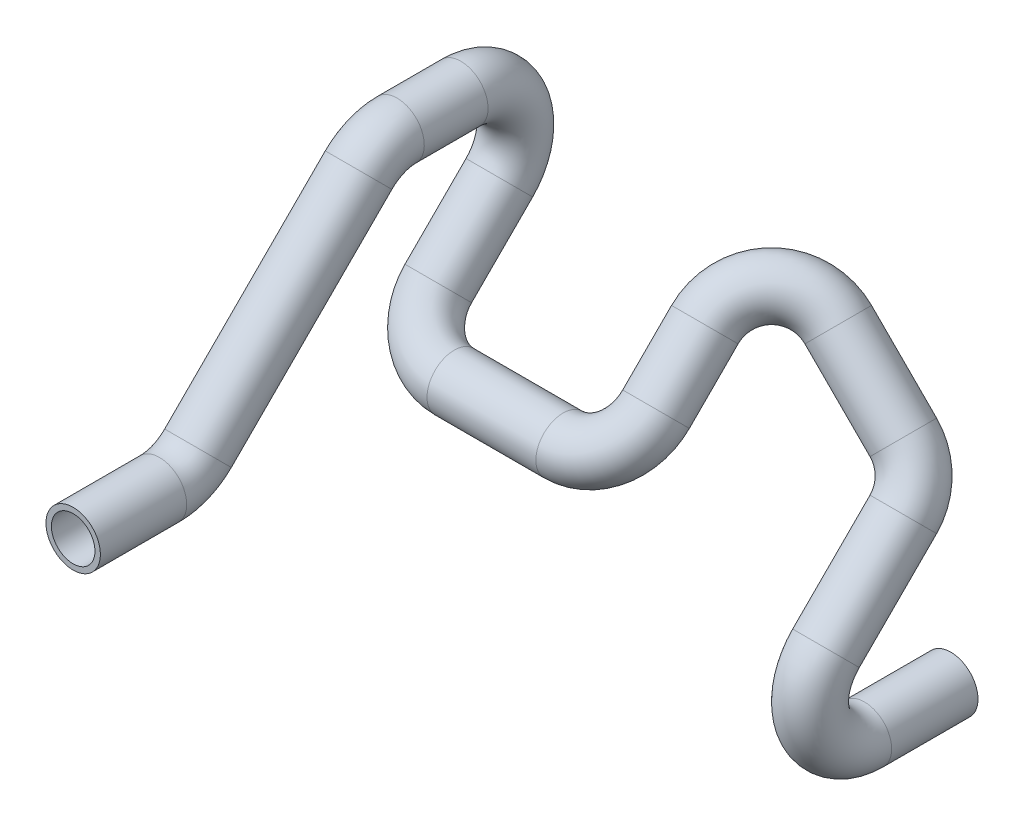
ISO-10303-21;
HEADER;
FILE_DESCRIPTION(('STEP AP214'),'2;1');
FILE_NAME('part.step','',(''),(''),'','','');
FILE_SCHEMA(('AUTOMOTIVE_DESIGN { 1 0 10303 214 1 1 1 1 }'));
ENDSEC;
DATA;
#1=APPLICATION_CONTEXT('core data for automotive mechanical design processes');
#2=APPLICATION_PROTOCOL_DEFINITION('international standard','automotive_design',2000,#1);
#3=PRODUCT_CONTEXT('',#1,'mechanical');
#4=PRODUCT('Part','Part','',(#3));
#5=PRODUCT_RELATED_PRODUCT_CATEGORY('part','',(#4));
#6=PRODUCT_DEFINITION_FORMATION('','',#4);
#7=PRODUCT_DEFINITION_CONTEXT('part definition',#1,'design');
#8=PRODUCT_DEFINITION('design','',#6,#7);
#9=PRODUCT_DEFINITION_SHAPE('','',#8);
#10=(LENGTH_UNIT() NAMED_UNIT(*) SI_UNIT(.MILLI.,.METRE.));
#11=(NAMED_UNIT(*) PLANE_ANGLE_UNIT() SI_UNIT($,.RADIAN.));
#12=(NAMED_UNIT(*) SI_UNIT($,.STERADIAN.) SOLID_ANGLE_UNIT());
#13=UNCERTAINTY_MEASURE_WITH_UNIT(LENGTH_MEASURE(1.E-05),#10,'distance_accuracy_value','');
#14=(GEOMETRIC_REPRESENTATION_CONTEXT(3) GLOBAL_UNCERTAINTY_ASSIGNED_CONTEXT((#13)) GLOBAL_UNIT_ASSIGNED_CONTEXT((#10,
#11,#12)) REPRESENTATION_CONTEXT('',''));
#15=CARTESIAN_POINT('',(0.,0.,0.));
#16=DIRECTION('',(0.,0.,1.));
#17=DIRECTION('',(1.,0.,0.));
#18=AXIS2_PLACEMENT_3D('',#15,#16,#17);
#19=CARTESIAN_POINT('',(-14.8789755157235,-44.9012806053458,-72.4802561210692));
#20=DIRECTION('',(0.,0.,-1.));
#21=DIRECTION('',(0.,1.,0.));
#22=AXIS2_PLACEMENT_3D('',#19,#20,#21);
#23=CYLINDRICAL_SURFACE('',#22,6.35);
#24=CARTESIAN_POINT('',(-14.8789755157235,-44.9012806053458,-72.4802561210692));
#25=DIRECTION('',(0.,0.,1.));
#26=DIRECTION('',(0.333333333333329,0.942809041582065,0.));
#27=AXIS2_PLACEMENT_3D('',#24,#25,#26);
#28=CIRCLE('',#27,6.35);
#29=CARTESIAN_POINT('',(-14.8789755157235,-51.2512806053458,-72.4802561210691));
#30=VERTEX_POINT('',#29);
#31=EDGE_CURVE('E41',#30,#30,#28,.T.);
#32=ORIENTED_EDGE('',*,*,#31,.F.);
#33=EDGE_LOOP('',(#32));
#34=FACE_BOUND('',#33,.T.);
#35=CARTESIAN_POINT('',(-14.8789755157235,-44.9012806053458,-92.6197438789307));
#36=DIRECTION('',(0.,0.,1.));
#37=DIRECTION('',(0.333333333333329,0.942809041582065,0.));
#38=AXIS2_PLACEMENT_3D('',#35,#36,#37);
#39=CIRCLE('',#38,6.35);
#40=CARTESIAN_POINT('',(-12.7623088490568,-38.9144431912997,-92.6197438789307));
#41=VERTEX_POINT('',#40);
#42=EDGE_CURVE('E10',#41,#41,#39,.T.);
#43=ORIENTED_EDGE('',*,*,#42,.T.);
#44=EDGE_LOOP('',(#43));
#45=FACE_BOUND('',#44,.T.);
#46=ADVANCED_FACE('F31',(#34,#45),#23,.T.);
#47=CARTESIAN_POINT('',(-14.8789755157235,-44.9012806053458,-72.4802561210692));
#48=DIRECTION('',(0.,0.,-1.));
#49=DIRECTION('',(0.,1.,0.));
#50=AXIS2_PLACEMENT_3D('',#47,#48,#49);
#51=CYLINDRICAL_SURFACE('',#50,5.08);
#52=CARTESIAN_POINT('',(-14.8789755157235,-44.9012806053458,-72.4802561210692));
#53=DIRECTION('',(0.,0.,1.));
#54=DIRECTION('',(0.333333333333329,0.942809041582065,0.));
#55=AXIS2_PLACEMENT_3D('',#52,#53,#54);
#56=CIRCLE('',#55,5.08);
#57=CARTESIAN_POINT('',(-14.8789755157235,-49.9812806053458,-72.4802561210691));
#58=VERTEX_POINT('',#57);
#59=EDGE_CURVE('E45',#58,#58,#56,.T.);
#60=ORIENTED_EDGE('',*,*,#59,.T.);
#61=EDGE_LOOP('',(#60));
#62=FACE_BOUND('',#61,.T.);
#63=CARTESIAN_POINT('',(-14.8789755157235,-44.9012806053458,-92.6197438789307));
#64=DIRECTION('',(0.,0.,1.));
#65=DIRECTION('',(0.333333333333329,0.942809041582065,0.));
#66=AXIS2_PLACEMENT_3D('',#63,#64,#65);
#67=CIRCLE('',#66,5.08);
#68=CARTESIAN_POINT('',(-13.1856421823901,-40.1118106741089,-92.6197438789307));
#69=VERTEX_POINT('',#68);
#70=EDGE_CURVE('E37',#69,#69,#67,.T.);
#71=ORIENTED_EDGE('',*,*,#70,.F.);
#72=EDGE_LOOP('',(#71));
#73=FACE_BOUND('',#72,.T.);
#74=ADVANCED_FACE('F169',(#62,#73),#51,.F.);
#75=CARTESIAN_POINT('',(-14.8789755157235,-32.2012806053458,-72.4802561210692));
#76=DIRECTION('',(1.,0.,0.));
#77=DIRECTION('',(0.,0.,-1.));
#78=AXIS2_PLACEMENT_3D('',#75,#76,#77);
#79=TOROIDAL_SURFACE('',#78,12.7,6.35);
#80=CARTESIAN_POINT('',(-14.8789755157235,-23.2210244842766,-63.5000000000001));
#81=DIRECTION('',(0.,0.707106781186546,-0.707106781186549));
#82=DIRECTION('',(0.333333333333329,-0.666666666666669,-0.666666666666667));
#83=AXIS2_PLACEMENT_3D('',#80,#81,#82);
#84=CIRCLE('',#83,6.35);
#85=CARTESIAN_POINT('',(-14.8789755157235,-18.730896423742,-59.0098719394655));
#86=VERTEX_POINT('',#85);
#87=EDGE_CURVE('E50',#86,#86,#84,.T.);
#88=CARTESIAN_POINT('',(-14.8789755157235,-32.2012806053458,-72.4802561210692));
#89=DIRECTION('',(1.,0.,0.));
#90=DIRECTION('',(0.,0.,-1.));
#91=AXIS2_PLACEMENT_3D('',#88,#89,#90);
#92=CIRCLE('',#91,19.05);
#93=EDGE_CURVE('',#86,#30,#92,.T.);
#94=ORIENTED_EDGE('',*,*,#87,.F.);
#95=ORIENTED_EDGE('',*,*,#31,.T.);
#96=ORIENTED_EDGE('',*,*,#93,.T.);
#97=ORIENTED_EDGE('',*,*,#93,.F.);
#98=EDGE_LOOP('',(#94,#96,#95,#97));
#99=FACE_BOUND('',#98,.T.);
#100=ADVANCED_FACE('F174',(#99),#79,.T.);
#101=CARTESIAN_POINT('',(-14.8789755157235,-32.2012806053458,-72.4802561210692));
#102=DIRECTION('',(1.,0.,0.));
#103=DIRECTION('',(0.,0.,-1.));
#104=AXIS2_PLACEMENT_3D('',#101,#102,#103);
#105=TOROIDAL_SURFACE('',#104,12.7,5.08);
#106=CARTESIAN_POINT('',(-14.8789755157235,-23.2210244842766,-63.5000000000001));
#107=DIRECTION('',(0.,0.707106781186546,-0.707106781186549));
#108=DIRECTION('',(0.333333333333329,-0.666666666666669,-0.666666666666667));
#109=AXIS2_PLACEMENT_3D('',#106,#107,#108);
#110=CIRCLE('',#109,5.08);
#111=CARTESIAN_POINT('',(-14.8789755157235,-19.6289220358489,-59.9078975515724));
#112=VERTEX_POINT('',#111);
#113=EDGE_CURVE('E53',#112,#112,#110,.T.);
#114=CARTESIAN_POINT('',(-14.8789755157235,-32.2012806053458,-72.4802561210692));
#115=DIRECTION('',(1.,0.,0.));
#116=DIRECTION('',(0.,0.,-1.));
#117=AXIS2_PLACEMENT_3D('',#114,#115,#116);
#118=CIRCLE('',#117,17.78);
#119=EDGE_CURVE('',#112,#58,#118,.T.);
#120=ORIENTED_EDGE('',*,*,#113,.T.);
#121=ORIENTED_EDGE('',*,*,#59,.F.);
#122=ORIENTED_EDGE('',*,*,#119,.T.);
#123=ORIENTED_EDGE('',*,*,#119,.F.);
#124=EDGE_LOOP('',(#120,#122,#121,#123));
#125=FACE_BOUND('',#124,.T.);
#126=ADVANCED_FACE('F179',(#125),#105,.F.);
#127=CARTESIAN_POINT('',(-14.8789755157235,-5.1847532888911,-81.5362711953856));
#128=DIRECTION('',(0.,-0.707106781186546,0.707106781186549));
#129=DIRECTION('',(0.,-0.707106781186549,-0.707106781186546));
#130=AXIS2_PLACEMENT_3D('',#127,#128,#129);
#131=CYLINDRICAL_SURFACE('',#130,6.35);
#132=CARTESIAN_POINT('',(-14.8789755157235,-5.1847532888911,-81.5362711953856));
#133=DIRECTION('',(0.,0.707106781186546,-0.707106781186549));
#134=DIRECTION('',(0.333333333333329,-0.666666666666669,-0.666666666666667));
#135=AXIS2_PLACEMENT_3D('',#132,#133,#134);
#136=CIRCLE('',#135,6.35);
#137=CARTESIAN_POINT('',(-9.69422222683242,-7.77712993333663,-84.1286478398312));
#138=VERTEX_POINT('',#137);
#139=EDGE_CURVE('E56',#138,#138,#136,.T.);
#140=ORIENTED_EDGE('',*,*,#139,.F.);
#141=EDGE_LOOP('',(#140));
#142=FACE_BOUND('',#141,.T.);
#143=ORIENTED_EDGE('',*,*,#87,.T.);
#144=EDGE_LOOP('',(#143));
#145=FACE_BOUND('',#144,.T.);
#146=ADVANCED_FACE('F185',(#142,#145),#131,.T.);
#147=CARTESIAN_POINT('',(-14.8789755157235,-5.1847532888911,-81.5362711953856));
#148=DIRECTION('',(0.,-0.707106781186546,0.707106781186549));
#149=DIRECTION('',(0.,-0.707106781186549,-0.707106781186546));
#150=AXIS2_PLACEMENT_3D('',#147,#148,#149);
#151=CYLINDRICAL_SURFACE('',#150,5.08);
#152=CARTESIAN_POINT('',(-14.8789755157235,-5.1847532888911,-81.5362711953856));
#153=DIRECTION('',(0.,0.707106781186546,-0.707106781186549));
#154=DIRECTION('',(0.333333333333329,-0.666666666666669,-0.666666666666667));
#155=AXIS2_PLACEMENT_3D('',#152,#153,#154);
#156=CIRCLE('',#155,5.08);
#157=CARTESIAN_POINT('',(-10.7311728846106,-7.25865460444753,-83.6101725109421));
#158=VERTEX_POINT('',#157);
#159=EDGE_CURVE('E59',#158,#158,#156,.T.);
#160=ORIENTED_EDGE('',*,*,#159,.T.);
#161=EDGE_LOOP('',(#160));
#162=FACE_BOUND('',#161,.T.);
#163=ORIENTED_EDGE('',*,*,#113,.F.);
#164=EDGE_LOOP('',(#163));
#165=FACE_BOUND('',#164,.T.);
#166=ADVANCED_FACE('F192',(#162,#165),#151,.F.);
#167=CARTESIAN_POINT('',(-25.2484820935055,0.,-76.3515179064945));
#168=DIRECTION('',(-0.577350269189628,-0.577350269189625,-0.577350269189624));
#169=DIRECTION('',(0.707106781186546,-0.707106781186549,0.));
#170=AXIS2_PLACEMENT_3D('',#167,#168,#169);
#171=TOROIDAL_SURFACE('',#170,12.7,6.35);
#172=CARTESIAN_POINT('',(-20.0637288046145,5.184753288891,-86.7210244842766));
#173=DIRECTION('',(-0.707106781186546,0.707106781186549,0.));
#174=DIRECTION('',(0.,0.,-1.));
#175=AXIS2_PLACEMENT_3D('',#172,#173,#174);
#176=CIRCLE('',#175,6.35);
#177=CARTESIAN_POINT('',(-17.471352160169,7.77712993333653,-91.9057777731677));
#178=VERTEX_POINT('',#177);
#179=EDGE_CURVE('E62',#178,#178,#176,.T.);
#180=CARTESIAN_POINT('',(-25.2484820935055,0.,-76.3515179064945));
#181=DIRECTION('',(-0.577350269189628,-0.577350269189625,-0.577350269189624));
#182=DIRECTION('',(0.707106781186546,-0.707106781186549,0.));
#183=AXIS2_PLACEMENT_3D('',#180,#181,#182);
#184=CIRCLE('',#183,19.05);
#185=EDGE_CURVE('',#178,#138,#184,.T.);
#186=ORIENTED_EDGE('',*,*,#179,.F.);
#187=ORIENTED_EDGE('',*,*,#139,.T.);
#188=ORIENTED_EDGE('',*,*,#185,.T.);
#189=ORIENTED_EDGE('',*,*,#185,.F.);
#190=EDGE_LOOP('',(#186,#188,#187,#189));
#191=FACE_BOUND('',#190,.T.);
#192=ADVANCED_FACE('F196',(#191),#171,.T.);
#193=CARTESIAN_POINT('',(-25.2484820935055,0.,-76.3515179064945));
#194=DIRECTION('',(-0.577350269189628,-0.577350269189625,-0.577350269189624));
#195=DIRECTION('',(0.707106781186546,-0.707106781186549,0.));
#196=AXIS2_PLACEMENT_3D('',#193,#194,#195);
#197=TOROIDAL_SURFACE('',#196,12.7,5.08);
#198=CARTESIAN_POINT('',(-20.0637288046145,5.184753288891,-86.7210244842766));
#199=DIRECTION('',(-0.707106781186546,0.707106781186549,0.));
#200=DIRECTION('',(0.,0.,-1.));
#201=AXIS2_PLACEMENT_3D('',#198,#199,#200);
#202=CIRCLE('',#201,5.08);
#203=CARTESIAN_POINT('',(-17.9898274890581,7.25865460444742,-90.8688271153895));
#204=VERTEX_POINT('',#203);
#205=EDGE_CURVE('E65',#204,#204,#202,.T.);
#206=CARTESIAN_POINT('',(-25.2484820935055,0.,-76.3515179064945));
#207=DIRECTION('',(-0.577350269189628,-0.577350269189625,-0.577350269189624));
#208=DIRECTION('',(0.707106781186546,-0.707106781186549,0.));
#209=AXIS2_PLACEMENT_3D('',#206,#207,#208);
#210=CIRCLE('',#209,17.78);
#211=EDGE_CURVE('',#204,#158,#210,.T.);
#212=ORIENTED_EDGE('',*,*,#205,.T.);
#213=ORIENTED_EDGE('',*,*,#159,.F.);
#214=ORIENTED_EDGE('',*,*,#211,.T.);
#215=ORIENTED_EDGE('',*,*,#211,.F.);
#216=EDGE_LOOP('',(#212,#214,#213,#215));
#217=FACE_BOUND('',#216,.T.);
#218=ADVANCED_FACE('F200',(#217),#197,.F.);
#219=CARTESIAN_POINT('',(-35.2457401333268,20.3667646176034,-86.7210244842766));
#220=DIRECTION('',(0.707106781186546,-0.707106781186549,0.));
#221=DIRECTION('',(0.707106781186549,0.707106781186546,0.));
#222=AXIS2_PLACEMENT_3D('',#219,#220,#221);
#223=CYLINDRICAL_SURFACE('',#222,6.35);
#224=CARTESIAN_POINT('',(-35.2457401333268,20.3667646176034,-86.7210244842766));
#225=DIRECTION('',(-0.707106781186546,0.707106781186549,0.));
#226=DIRECTION('',(0.,0.,-1.));
#227=AXIS2_PLACEMENT_3D('',#224,#225,#226);
#228=CIRCLE('',#227,6.35);
#229=CARTESIAN_POINT('',(-32.6533634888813,22.9591412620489,-91.9057777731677));
#230=VERTEX_POINT('',#229);
#231=EDGE_CURVE('E68',#230,#230,#228,.T.);
#232=ORIENTED_EDGE('',*,*,#231,.F.);
#233=EDGE_LOOP('',(#232));
#234=FACE_BOUND('',#233,.T.);
#235=ORIENTED_EDGE('',*,*,#179,.T.);
#236=EDGE_LOOP('',(#235));
#237=FACE_BOUND('',#236,.T.);
#238=ADVANCED_FACE('F204',(#234,#237),#223,.T.);
#239=CARTESIAN_POINT('',(-35.2457401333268,20.3667646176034,-86.7210244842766));
#240=DIRECTION('',(0.707106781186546,-0.707106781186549,0.));
#241=DIRECTION('',(0.707106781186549,0.707106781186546,0.));
#242=AXIS2_PLACEMENT_3D('',#239,#240,#241);
#243=CYLINDRICAL_SURFACE('',#242,5.08);
#244=CARTESIAN_POINT('',(-35.2457401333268,20.3667646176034,-86.7210244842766));
#245=DIRECTION('',(-0.707106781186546,0.707106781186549,0.));
#246=DIRECTION('',(0.,0.,-1.));
#247=AXIS2_PLACEMENT_3D('',#244,#245,#246);
#248=CIRCLE('',#247,5.08);
#249=CARTESIAN_POINT('',(-33.1718388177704,22.4406659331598,-90.8688271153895));
#250=VERTEX_POINT('',#249);
#251=EDGE_CURVE('E71',#250,#250,#248,.T.);
#252=ORIENTED_EDGE('',*,*,#251,.T.);
#253=EDGE_LOOP('',(#252));
#254=FACE_BOUND('',#253,.T.);
#255=ORIENTED_EDGE('',*,*,#205,.F.);
#256=EDGE_LOOP('',(#255));
#257=FACE_BOUND('',#256,.T.);
#258=ADVANCED_FACE('F208',(#254,#257),#243,.F.);
#259=CARTESIAN_POINT('',(-40.4304934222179,15.1820113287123,-76.3515179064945));
#260=DIRECTION('',(-0.577350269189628,-0.577350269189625,-0.577350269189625));
#261=DIRECTION('',(-0.707106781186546,0.,0.707106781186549));
#262=AXIS2_PLACEMENT_3D('',#259,#260,#261);
#263=TOROIDAL_SURFACE('',#262,12.7,6.35);
#264=CARTESIAN_POINT('',(-50.8,20.3667646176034,-71.1667646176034));
#265=DIRECTION('',(0.,-0.707106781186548,0.707106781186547));
#266=DIRECTION('',(-1.,0.,0.));
#267=AXIS2_PLACEMENT_3D('',#264,#265,#266);
#268=CIRCLE('',#267,6.35);
#269=CARTESIAN_POINT('',(-55.984753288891,22.9591412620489,-68.5743879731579));
#270=VERTEX_POINT('',#269);
#271=EDGE_CURVE('E74',#270,#270,#268,.T.);
#272=CARTESIAN_POINT('',(-40.4304934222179,15.1820113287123,-76.3515179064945));
#273=DIRECTION('',(-0.577350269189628,-0.577350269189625,-0.577350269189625));
#274=DIRECTION('',(-0.707106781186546,0.,0.707106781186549));
#275=AXIS2_PLACEMENT_3D('',#272,#273,#274);
#276=CIRCLE('',#275,19.05);
#277=EDGE_CURVE('',#270,#230,#276,.T.);
#278=ORIENTED_EDGE('',*,*,#271,.F.);
#279=ORIENTED_EDGE('',*,*,#231,.T.);
#280=ORIENTED_EDGE('',*,*,#277,.T.);
#281=ORIENTED_EDGE('',*,*,#277,.F.);
#282=EDGE_LOOP('',(#278,#280,#279,#281));
#283=FACE_BOUND('',#282,.T.);
#284=ADVANCED_FACE('F212',(#283),#263,.T.);
#285=CARTESIAN_POINT('',(-40.4304934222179,15.1820113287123,-76.3515179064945));
#286=DIRECTION('',(-0.577350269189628,-0.577350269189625,-0.577350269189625));
#287=DIRECTION('',(-0.707106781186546,0.,0.707106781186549));
#288=AXIS2_PLACEMENT_3D('',#285,#286,#287);
#289=TOROIDAL_SURFACE('',#288,12.7,5.08);
#290=CARTESIAN_POINT('',(-50.8,20.3667646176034,-71.1667646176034));
#291=DIRECTION('',(0.,-0.707106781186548,0.707106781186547));
#292=DIRECTION('',(-1.,0.,0.));
#293=AXIS2_PLACEMENT_3D('',#290,#291,#292);
#294=CIRCLE('',#293,5.08);
#295=CARTESIAN_POINT('',(-54.9478026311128,22.4406659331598,-69.092863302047));
#296=VERTEX_POINT('',#295);
#297=EDGE_CURVE('E77',#296,#296,#294,.T.);
#298=CARTESIAN_POINT('',(-40.4304934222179,15.1820113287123,-76.3515179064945));
#299=DIRECTION('',(-0.577350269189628,-0.577350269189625,-0.577350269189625));
#300=DIRECTION('',(-0.707106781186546,0.,0.707106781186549));
#301=AXIS2_PLACEMENT_3D('',#298,#299,#300);
#302=CIRCLE('',#301,17.78);
#303=EDGE_CURVE('',#296,#250,#302,.T.);
#304=ORIENTED_EDGE('',*,*,#297,.T.);
#305=ORIENTED_EDGE('',*,*,#251,.F.);
#306=ORIENTED_EDGE('',*,*,#303,.T.);
#307=ORIENTED_EDGE('',*,*,#303,.F.);
#308=EDGE_LOOP('',(#304,#306,#305,#307));
#309=FACE_BOUND('',#308,.T.);
#310=ADVANCED_FACE('F216',(#309),#289,.F.);
#311=CARTESIAN_POINT('',(-50.8,8.98025612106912,-59.7802561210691));
#312=DIRECTION('',(0.,0.707106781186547,-0.707106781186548));
#313=DIRECTION('',(0.,0.707106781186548,0.707106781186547));
#314=AXIS2_PLACEMENT_3D('',#311,#312,#313);
#315=CYLINDRICAL_SURFACE('',#314,6.35);
#316=CARTESIAN_POINT('',(-50.8,8.98025612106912,-59.7802561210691));
#317=DIRECTION('',(0.,-0.707106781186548,0.707106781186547));
#318=DIRECTION('',(-1.,0.,0.));
#319=AXIS2_PLACEMENT_3D('',#316,#317,#318);
#320=CIRCLE('',#319,6.35);
#321=CARTESIAN_POINT('',(-44.45,8.9802561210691,-59.7802561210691));
#322=VERTEX_POINT('',#321);
#323=EDGE_CURVE('E80',#322,#322,#320,.T.);
#324=ORIENTED_EDGE('',*,*,#323,.F.);
#325=EDGE_LOOP('',(#324));
#326=FACE_BOUND('',#325,.T.);
#327=ORIENTED_EDGE('',*,*,#271,.T.);
#328=EDGE_LOOP('',(#327));
#329=FACE_BOUND('',#328,.T.);
#330=ADVANCED_FACE('F220',(#326,#329),#315,.T.);
#331=CARTESIAN_POINT('',(-50.8,8.98025612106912,-59.7802561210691));
#332=DIRECTION('',(0.,0.707106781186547,-0.707106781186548));
#333=DIRECTION('',(0.,0.707106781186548,0.707106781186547));
#334=AXIS2_PLACEMENT_3D('',#331,#332,#333);
#335=CYLINDRICAL_SURFACE('',#334,5.08);
#336=CARTESIAN_POINT('',(-50.8,8.98025612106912,-59.7802561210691));
#337=DIRECTION('',(0.,-0.707106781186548,0.707106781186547));
#338=DIRECTION('',(-1.,0.,0.));
#339=AXIS2_PLACEMENT_3D('',#336,#337,#338);
#340=CIRCLE('',#339,5.08);
#341=CARTESIAN_POINT('',(-45.72,8.98025612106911,-59.7802561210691));
#342=VERTEX_POINT('',#341);
#343=EDGE_CURVE('E83',#342,#342,#340,.T.);
#344=ORIENTED_EDGE('',*,*,#343,.T.);
#345=EDGE_LOOP('',(#344));
#346=FACE_BOUND('',#345,.T.);
#347=ORIENTED_EDGE('',*,*,#297,.F.);
#348=EDGE_LOOP('',(#347));
#349=FACE_BOUND('',#348,.T.);
#350=ADVANCED_FACE('F224',(#346,#349),#335,.F.);
#351=CARTESIAN_POINT('',(-63.5,8.98025612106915,-59.7802561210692));
#352=DIRECTION('',(0.,0.707106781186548,0.707106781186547));
#353=DIRECTION('',(0.,-0.707106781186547,0.707106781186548));
#354=AXIS2_PLACEMENT_3D('',#351,#352,#353);
#355=TOROIDAL_SURFACE('',#354,12.7,6.35);
#356=CARTESIAN_POINT('',(-63.5,0.,-50.8));
#357=DIRECTION('',(-1.,0.,0.));
#358=DIRECTION('',(0.,0.707106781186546,-0.707106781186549));
#359=AXIS2_PLACEMENT_3D('',#356,#357,#358);
#360=CIRCLE('',#359,6.35);
#361=CARTESIAN_POINT('',(-63.5,-4.49012806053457,-46.3098719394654));
#362=VERTEX_POINT('',#361);
#363=EDGE_CURVE('E86',#362,#362,#360,.T.);
#364=CARTESIAN_POINT('',(-63.5,8.98025612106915,-59.7802561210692));
#365=DIRECTION('',(0.,0.707106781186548,0.707106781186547));
#366=DIRECTION('',(0.,-0.707106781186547,0.707106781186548));
#367=AXIS2_PLACEMENT_3D('',#364,#365,#366);
#368=CIRCLE('',#367,19.05);
#369=EDGE_CURVE('',#362,#322,#368,.T.);
#370=ORIENTED_EDGE('',*,*,#363,.F.);
#371=ORIENTED_EDGE('',*,*,#323,.T.);
#372=ORIENTED_EDGE('',*,*,#369,.T.);
#373=ORIENTED_EDGE('',*,*,#369,.F.);
#374=EDGE_LOOP('',(#370,#372,#371,#373));
#375=FACE_BOUND('',#374,.T.);
#376=ADVANCED_FACE('F228',(#375),#355,.T.);
#377=CARTESIAN_POINT('',(-63.5,8.98025612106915,-59.7802561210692));
#378=DIRECTION('',(0.,0.707106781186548,0.707106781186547));
#379=DIRECTION('',(0.,-0.707106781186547,0.707106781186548));
#380=AXIS2_PLACEMENT_3D('',#377,#378,#379);
#381=TOROIDAL_SURFACE('',#380,12.7,5.08);
#382=CARTESIAN_POINT('',(-63.5,0.,-50.8));
#383=DIRECTION('',(-1.,0.,0.));
#384=DIRECTION('',(0.,0.707106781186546,-0.707106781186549));
#385=AXIS2_PLACEMENT_3D('',#382,#383,#384);
#386=CIRCLE('',#385,5.08);
#387=CARTESIAN_POINT('',(-63.5,-3.59210244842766,-47.2078975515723));
#388=VERTEX_POINT('',#387);
#389=EDGE_CURVE('E89',#388,#388,#386,.T.);
#390=CARTESIAN_POINT('',(-63.5,8.98025612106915,-59.7802561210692));
#391=DIRECTION('',(0.,0.707106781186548,0.707106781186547));
#392=DIRECTION('',(0.,-0.707106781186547,0.707106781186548));
#393=AXIS2_PLACEMENT_3D('',#390,#391,#392);
#394=CIRCLE('',#393,17.78);
#395=EDGE_CURVE('',#388,#342,#394,.T.);
#396=ORIENTED_EDGE('',*,*,#389,.T.);
#397=ORIENTED_EDGE('',*,*,#343,.F.);
#398=ORIENTED_EDGE('',*,*,#395,.T.);
#399=ORIENTED_EDGE('',*,*,#395,.F.);
#400=EDGE_LOOP('',(#396,#398,#397,#399));
#401=FACE_BOUND('',#400,.T.);
#402=ADVANCED_FACE('F232',(#401),#381,.F.);
#403=CARTESIAN_POINT('',(-88.9,0.,-50.8));
#404=DIRECTION('',(1.,0.,0.));
#405=DIRECTION('',(0.,0.,-1.));
#406=AXIS2_PLACEMENT_3D('',#403,#404,#405);
#407=CYLINDRICAL_SURFACE('',#406,6.35);
#408=CARTESIAN_POINT('',(-88.9,0.,-50.8));
#409=DIRECTION('',(-1.,0.,0.));
#410=DIRECTION('',(0.,0.707106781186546,-0.707106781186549));
#411=AXIS2_PLACEMENT_3D('',#408,#409,#410);
#412=CIRCLE('',#411,6.35);
#413=CARTESIAN_POINT('',(-88.9,-4.49012806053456,-46.3098719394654));
#414=VERTEX_POINT('',#413);
#415=EDGE_CURVE('E92',#414,#414,#412,.T.);
#416=ORIENTED_EDGE('',*,*,#415,.F.);
#417=EDGE_LOOP('',(#416));
#418=FACE_BOUND('',#417,.T.);
#419=ORIENTED_EDGE('',*,*,#363,.T.);
#420=EDGE_LOOP('',(#419));
#421=FACE_BOUND('',#420,.T.);
#422=ADVANCED_FACE('F236',(#418,#421),#407,.T.);
#423=CARTESIAN_POINT('',(-88.9,0.,-50.8));
#424=DIRECTION('',(1.,0.,0.));
#425=DIRECTION('',(0.,0.,-1.));
#426=AXIS2_PLACEMENT_3D('',#423,#424,#425);
#427=CYLINDRICAL_SURFACE('',#426,5.08);
#428=CARTESIAN_POINT('',(-88.9,0.,-50.8));
#429=DIRECTION('',(-1.,0.,0.));
#430=DIRECTION('',(0.,0.707106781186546,-0.707106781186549));
#431=AXIS2_PLACEMENT_3D('',#428,#429,#430);
#432=CIRCLE('',#431,5.08);
#433=CARTESIAN_POINT('',(-88.9,-3.59210244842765,-47.2078975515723));
#434=VERTEX_POINT('',#433);
#435=EDGE_CURVE('E95',#434,#434,#432,.T.);
#436=ORIENTED_EDGE('',*,*,#435,.T.);
#437=EDGE_LOOP('',(#436));
#438=FACE_BOUND('',#437,.T.);
#439=ORIENTED_EDGE('',*,*,#389,.F.);
#440=EDGE_LOOP('',(#439));
#441=FACE_BOUND('',#440,.T.);
#442=ADVANCED_FACE('F240',(#438,#441),#427,.F.);
#443=CARTESIAN_POINT('',(-88.9,8.98025612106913,-59.7802561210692));
#444=DIRECTION('',(0.,0.707106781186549,0.707106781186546));
#445=DIRECTION('',(0.,-0.707106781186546,0.707106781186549));
#446=AXIS2_PLACEMENT_3D('',#443,#444,#445);
#447=TOROIDAL_SURFACE('',#446,12.7,6.35);
#448=CARTESIAN_POINT('',(-101.6,8.98025612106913,-59.7802561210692));
#449=DIRECTION('',(0.,0.707106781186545,-0.70710678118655));
#450=DIRECTION('',(1.,0.,0.));
#451=AXIS2_PLACEMENT_3D('',#448,#449,#450);
#452=CIRCLE('',#451,6.35);
#453=CARTESIAN_POINT('',(-107.95,8.98025612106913,-59.7802561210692));
#454=VERTEX_POINT('',#453);
#455=EDGE_CURVE('E98',#454,#454,#452,.T.);
#456=CARTESIAN_POINT('',(-88.9,8.98025612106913,-59.7802561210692));
#457=DIRECTION('',(0.,0.707106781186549,0.707106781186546));
#458=DIRECTION('',(0.,-0.707106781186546,0.707106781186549));
#459=AXIS2_PLACEMENT_3D('',#456,#457,#458);
#460=CIRCLE('',#459,19.05);
#461=EDGE_CURVE('',#454,#414,#460,.T.);
#462=ORIENTED_EDGE('',*,*,#455,.F.);
#463=ORIENTED_EDGE('',*,*,#415,.T.);
#464=ORIENTED_EDGE('',*,*,#461,.T.);
#465=ORIENTED_EDGE('',*,*,#461,.F.);
#466=EDGE_LOOP('',(#462,#464,#463,#465));
#467=FACE_BOUND('',#466,.T.);
#468=ADVANCED_FACE('F244',(#467),#447,.T.);
#469=CARTESIAN_POINT('',(-88.9,8.98025612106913,-59.7802561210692));
#470=DIRECTION('',(0.,0.707106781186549,0.707106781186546));
#471=DIRECTION('',(0.,-0.707106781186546,0.707106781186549));
#472=AXIS2_PLACEMENT_3D('',#469,#470,#471);
#473=TOROIDAL_SURFACE('',#472,12.7,5.08);
#474=CARTESIAN_POINT('',(-101.6,8.98025612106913,-59.7802561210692));
#475=DIRECTION('',(0.,0.707106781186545,-0.70710678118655));
#476=DIRECTION('',(1.,0.,0.));
#477=AXIS2_PLACEMENT_3D('',#474,#475,#476);
#478=CIRCLE('',#477,5.08);
#479=CARTESIAN_POINT('',(-106.68,8.98025612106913,-59.7802561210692));
#480=VERTEX_POINT('',#479);
#481=EDGE_CURVE('E101',#480,#480,#478,.T.);
#482=CARTESIAN_POINT('',(-88.9,8.98025612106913,-59.7802561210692));
#483=DIRECTION('',(0.,0.707106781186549,0.707106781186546));
#484=DIRECTION('',(0.,-0.707106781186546,0.707106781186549));
#485=AXIS2_PLACEMENT_3D('',#482,#483,#484);
#486=CIRCLE('',#485,17.78);
#487=EDGE_CURVE('',#480,#434,#486,.T.);
#488=ORIENTED_EDGE('',*,*,#481,.T.);
#489=ORIENTED_EDGE('',*,*,#435,.F.);
#490=ORIENTED_EDGE('',*,*,#487,.T.);
#491=ORIENTED_EDGE('',*,*,#487,.F.);
#492=EDGE_LOOP('',(#488,#490,#489,#491));
#493=FACE_BOUND('',#492,.T.);
#494=ADVANCED_FACE('F248',(#493),#473,.F.);
#495=CARTESIAN_POINT('',(-101.6,23.2210244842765,-74.0210244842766));
#496=DIRECTION('',(0.,-0.707106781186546,0.707106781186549));
#497=DIRECTION('',(0.,-0.707106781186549,-0.707106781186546));
#498=AXIS2_PLACEMENT_3D('',#495,#496,#497);
#499=CYLINDRICAL_SURFACE('',#498,6.35);
#500=CARTESIAN_POINT('',(-101.6,23.2210244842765,-74.0210244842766));
#501=DIRECTION('',(0.,0.707106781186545,-0.70710678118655));
#502=DIRECTION('',(1.,0.,0.));
#503=AXIS2_PLACEMENT_3D('',#500,#501,#502);
#504=CIRCLE('',#503,6.35);
#505=CARTESIAN_POINT('',(-101.6,18.7308964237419,-78.5111525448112));
#506=VERTEX_POINT('',#505);
#507=EDGE_CURVE('E104',#506,#506,#504,.T.);
#508=ORIENTED_EDGE('',*,*,#507,.F.);
#509=EDGE_LOOP('',(#508));
#510=FACE_BOUND('',#509,.T.);
#511=ORIENTED_EDGE('',*,*,#455,.T.);
#512=EDGE_LOOP('',(#511));
#513=FACE_BOUND('',#512,.T.);
#514=ADVANCED_FACE('F252',(#510,#513),#499,.T.);
#515=CARTESIAN_POINT('',(-101.6,23.2210244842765,-74.0210244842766));
#516=DIRECTION('',(0.,-0.707106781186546,0.707106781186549));
#517=DIRECTION('',(0.,-0.707106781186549,-0.707106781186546));
#518=AXIS2_PLACEMENT_3D('',#515,#516,#517);
#519=CYLINDRICAL_SURFACE('',#518,5.08);
#520=CARTESIAN_POINT('',(-101.6,23.2210244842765,-74.0210244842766));
#521=DIRECTION('',(0.,0.707106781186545,-0.70710678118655));
#522=DIRECTION('',(1.,0.,0.));
#523=AXIS2_PLACEMENT_3D('',#520,#521,#522);
#524=CIRCLE('',#523,5.08);
#525=CARTESIAN_POINT('',(-101.6,19.6289220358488,-77.6131269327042));
#526=VERTEX_POINT('',#525);
#527=EDGE_CURVE('E107',#526,#526,#524,.T.);
#528=ORIENTED_EDGE('',*,*,#527,.T.);
#529=EDGE_LOOP('',(#528));
#530=FACE_BOUND('',#529,.T.);
#531=ORIENTED_EDGE('',*,*,#481,.F.);
#532=EDGE_LOOP('',(#531));
#533=FACE_BOUND('',#532,.T.);
#534=ADVANCED_FACE('F256',(#530,#533),#519,.F.);
#535=CARTESIAN_POINT('',(-101.6,32.2012806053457,-65.0407683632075));
#536=DIRECTION('',(-1.,0.,0.));
#537=DIRECTION('',(0.,0.,1.));
#538=AXIS2_PLACEMENT_3D('',#535,#536,#537);
#539=TOROIDAL_SURFACE('',#538,12.7,6.35);
#540=CARTESIAN_POINT('',(-101.6,44.9012806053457,-65.0407683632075));
#541=DIRECTION('',(0.,0.,1.));
#542=DIRECTION('',(1.,0.,0.));
#543=AXIS2_PLACEMENT_3D('',#540,#541,#542);
#544=CIRCLE('',#543,6.35);
#545=CARTESIAN_POINT('',(-101.6,51.2512806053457,-65.0407683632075));
#546=VERTEX_POINT('',#545);
#547=EDGE_CURVE('E110',#546,#546,#544,.T.);
#548=CARTESIAN_POINT('',(-101.6,32.2012806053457,-65.0407683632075));
#549=DIRECTION('',(-1.,0.,0.));
#550=DIRECTION('',(0.,0.,1.));
#551=AXIS2_PLACEMENT_3D('',#548,#549,#550);
#552=CIRCLE('',#551,19.05);
#553=EDGE_CURVE('',#546,#506,#552,.T.);
#554=ORIENTED_EDGE('',*,*,#547,.F.);
#555=ORIENTED_EDGE('',*,*,#507,.T.);
#556=ORIENTED_EDGE('',*,*,#553,.T.);
#557=ORIENTED_EDGE('',*,*,#553,.F.);
#558=EDGE_LOOP('',(#554,#556,#555,#557));
#559=FACE_BOUND('',#558,.T.);
#560=ADVANCED_FACE('F260',(#559),#539,.T.);
#561=CARTESIAN_POINT('',(-101.6,32.2012806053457,-65.0407683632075));
#562=DIRECTION('',(-1.,0.,0.));
#563=DIRECTION('',(0.,0.,1.));
#564=AXIS2_PLACEMENT_3D('',#561,#562,#563);
#565=TOROIDAL_SURFACE('',#564,12.7,5.08);
#566=CARTESIAN_POINT('',(-101.6,44.9012806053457,-65.0407683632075));
#567=DIRECTION('',(0.,0.,1.));
#568=DIRECTION('',(1.,0.,0.));
#569=AXIS2_PLACEMENT_3D('',#566,#567,#568);
#570=CIRCLE('',#569,5.08);
#571=CARTESIAN_POINT('',(-101.6,49.9812806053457,-65.0407683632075));
#572=VERTEX_POINT('',#571);
#573=EDGE_CURVE('E113',#572,#572,#570,.T.);
#574=CARTESIAN_POINT('',(-101.6,32.2012806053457,-65.0407683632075));
#575=DIRECTION('',(-1.,0.,0.));
#576=DIRECTION('',(0.,0.,1.));
#577=AXIS2_PLACEMENT_3D('',#574,#575,#576);
#578=CIRCLE('',#577,17.78);
#579=EDGE_CURVE('',#572,#526,#578,.T.);
#580=ORIENTED_EDGE('',*,*,#573,.T.);
#581=ORIENTED_EDGE('',*,*,#527,.F.);
#582=ORIENTED_EDGE('',*,*,#579,.T.);
#583=ORIENTED_EDGE('',*,*,#579,.F.);
#584=EDGE_LOOP('',(#580,#582,#581,#583));
#585=FACE_BOUND('',#584,.T.);
#586=ADVANCED_FACE('F264',(#585),#565,.F.);
#587=CARTESIAN_POINT('',(-101.6,44.9012806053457,-50.1617928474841));
#588=DIRECTION('',(0.,0.,-1.));
#589=DIRECTION('',(-1.,0.,0.));
#590=AXIS2_PLACEMENT_3D('',#587,#588,#589);
#591=CYLINDRICAL_SURFACE('',#590,6.35);
#592=CARTESIAN_POINT('',(-101.6,44.9012806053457,-50.1617928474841));
#593=DIRECTION('',(0.,0.,1.));
#594=DIRECTION('',(1.,0.,0.));
#595=AXIS2_PLACEMENT_3D('',#592,#593,#594);
#596=CIRCLE('',#595,6.35);
#597=CARTESIAN_POINT('',(-101.6,51.2512806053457,-50.1617928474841));
#598=VERTEX_POINT('',#597);
#599=EDGE_CURVE('E116',#598,#598,#596,.T.);
#600=ORIENTED_EDGE('',*,*,#599,.F.);
#601=EDGE_LOOP('',(#600));
#602=FACE_BOUND('',#601,.T.);
#603=ORIENTED_EDGE('',*,*,#547,.T.);
#604=EDGE_LOOP('',(#603));
#605=FACE_BOUND('',#604,.T.);
#606=ADVANCED_FACE('F268',(#602,#605),#591,.T.);
#607=CARTESIAN_POINT('',(-101.6,44.9012806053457,-50.1617928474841));
#608=DIRECTION('',(0.,0.,-1.));
#609=DIRECTION('',(-1.,0.,0.));
#610=AXIS2_PLACEMENT_3D('',#607,#608,#609);
#611=CYLINDRICAL_SURFACE('',#610,5.08);
#612=CARTESIAN_POINT('',(-101.6,44.9012806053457,-50.1617928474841));
#613=DIRECTION('',(0.,0.,1.));
#614=DIRECTION('',(1.,0.,0.));
#615=AXIS2_PLACEMENT_3D('',#612,#613,#614);
#616=CIRCLE('',#615,5.08);
#617=CARTESIAN_POINT('',(-101.6,49.9812806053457,-50.1617928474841));
#618=VERTEX_POINT('',#617);
#619=EDGE_CURVE('E119',#618,#618,#616,.T.);
#620=ORIENTED_EDGE('',*,*,#619,.T.);
#621=EDGE_LOOP('',(#620));
#622=FACE_BOUND('',#621,.T.);
#623=ORIENTED_EDGE('',*,*,#573,.F.);
#624=EDGE_LOOP('',(#623));
#625=FACE_BOUND('',#624,.T.);
#626=ADVANCED_FACE('F272',(#622,#625),#611,.F.);
#627=CARTESIAN_POINT('',(-101.6,32.2012806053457,-50.1617928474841));
#628=DIRECTION('',(-1.,0.,0.));
#629=DIRECTION('',(0.,0.,1.));
#630=AXIS2_PLACEMENT_3D('',#627,#628,#629);
#631=TOROIDAL_SURFACE('',#630,12.7,6.35);
#632=CARTESIAN_POINT('',(-101.6,41.1815367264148,-41.181536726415));
#633=DIRECTION('',(0.,-0.707106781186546,0.707106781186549));
#634=DIRECTION('',(1.,0.,0.));
#635=AXIS2_PLACEMENT_3D('',#632,#633,#634);
#636=CIRCLE('',#635,6.35);
#637=CARTESIAN_POINT('',(-101.6,45.6716647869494,-36.6914086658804));
#638=VERTEX_POINT('',#637);
#639=EDGE_CURVE('E122',#638,#638,#636,.T.);
#640=CARTESIAN_POINT('',(-101.6,32.2012806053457,-50.1617928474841));
#641=DIRECTION('',(-1.,0.,0.));
#642=DIRECTION('',(0.,0.,1.));
#643=AXIS2_PLACEMENT_3D('',#640,#641,#642);
#644=CIRCLE('',#643,19.05);
#645=EDGE_CURVE('',#638,#598,#644,.T.);
#646=ORIENTED_EDGE('',*,*,#639,.F.);
#647=ORIENTED_EDGE('',*,*,#599,.T.);
#648=ORIENTED_EDGE('',*,*,#645,.T.);
#649=ORIENTED_EDGE('',*,*,#645,.F.);
#650=EDGE_LOOP('',(#646,#648,#647,#649));
#651=FACE_BOUND('',#650,.T.);
#652=ADVANCED_FACE('F276',(#651),#631,.T.);
#653=CARTESIAN_POINT('',(-101.6,32.2012806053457,-50.1617928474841));
#654=DIRECTION('',(-1.,0.,0.));
#655=DIRECTION('',(0.,0.,1.));
#656=AXIS2_PLACEMENT_3D('',#653,#654,#655);
#657=TOROIDAL_SURFACE('',#656,12.7,5.08);
#658=CARTESIAN_POINT('',(-101.6,41.1815367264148,-41.181536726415));
#659=DIRECTION('',(0.,-0.707106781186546,0.707106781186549));
#660=DIRECTION('',(1.,0.,0.));
#661=AXIS2_PLACEMENT_3D('',#658,#659,#660);
#662=CIRCLE('',#661,5.08);
#663=CARTESIAN_POINT('',(-101.6,44.7736391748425,-37.5894342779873));
#664=VERTEX_POINT('',#663);
#665=EDGE_CURVE('E125',#664,#664,#662,.T.);
#666=CARTESIAN_POINT('',(-101.6,32.2012806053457,-50.1617928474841));
#667=DIRECTION('',(-1.,0.,0.));
#668=DIRECTION('',(0.,0.,1.));
#669=AXIS2_PLACEMENT_3D('',#666,#667,#668);
#670=CIRCLE('',#669,17.78);
#671=EDGE_CURVE('',#664,#618,#670,.T.);
#672=ORIENTED_EDGE('',*,*,#665,.T.);
#673=ORIENTED_EDGE('',*,*,#619,.F.);
#674=ORIENTED_EDGE('',*,*,#671,.T.);
#675=ORIENTED_EDGE('',*,*,#671,.F.);
#676=EDGE_LOOP('',(#672,#674,#673,#675));
#677=FACE_BOUND('',#676,.T.);
#678=ADVANCED_FACE('F280',(#677),#657,.F.);
#679=CARTESIAN_POINT('',(-101.6,3.71974387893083,-3.71974387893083));
#680=DIRECTION('',(0.,0.707106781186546,-0.707106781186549));
#681=DIRECTION('',(0.,0.707106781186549,0.707106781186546));
#682=AXIS2_PLACEMENT_3D('',#679,#680,#681);
#683=CYLINDRICAL_SURFACE('',#682,6.35);
#684=CARTESIAN_POINT('',(-101.6,3.71974387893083,-3.71974387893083));
#685=DIRECTION('',(0.,-0.707106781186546,0.707106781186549));
#686=DIRECTION('',(1.,0.,0.));
#687=AXIS2_PLACEMENT_3D('',#684,#685,#686);
#688=CIRCLE('',#687,6.35);
#689=CARTESIAN_POINT('',(-101.6,-0.770384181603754,-8.2098719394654));
#690=VERTEX_POINT('',#689);
#691=EDGE_CURVE('E128',#690,#690,#688,.T.);
#692=ORIENTED_EDGE('',*,*,#691,.F.);
#693=EDGE_LOOP('',(#692));
#694=FACE_BOUND('',#693,.T.);
#695=ORIENTED_EDGE('',*,*,#639,.T.);
#696=EDGE_LOOP('',(#695));
#697=FACE_BOUND('',#696,.T.);
#698=ADVANCED_FACE('F284',(#694,#697),#683,.T.);
#699=CARTESIAN_POINT('',(-101.6,3.71974387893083,-3.71974387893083));
#700=DIRECTION('',(0.,0.707106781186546,-0.707106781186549));
#701=DIRECTION('',(0.,0.707106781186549,0.707106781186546));
#702=AXIS2_PLACEMENT_3D('',#699,#700,#701);
#703=CYLINDRICAL_SURFACE('',#702,5.08);
#704=CARTESIAN_POINT('',(-101.6,3.71974387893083,-3.71974387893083));
#705=DIRECTION('',(0.,-0.707106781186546,0.707106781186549));
#706=DIRECTION('',(1.,0.,0.));
#707=AXIS2_PLACEMENT_3D('',#704,#705,#706);
#708=CIRCLE('',#707,5.08);
#709=CARTESIAN_POINT('',(-101.6,0.127641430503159,-7.31184632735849));
#710=VERTEX_POINT('',#709);
#711=EDGE_CURVE('E131',#710,#710,#708,.T.);
#712=ORIENTED_EDGE('',*,*,#711,.T.);
#713=EDGE_LOOP('',(#712));
#714=FACE_BOUND('',#713,.T.);
#715=ORIENTED_EDGE('',*,*,#665,.F.);
#716=EDGE_LOOP('',(#715));
#717=FACE_BOUND('',#716,.T.);
#718=ADVANCED_FACE('F288',(#714,#717),#703,.F.);
#719=CARTESIAN_POINT('',(-101.6,12.7,5.2605122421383));
#720=DIRECTION('',(1.,0.,0.));
#721=DIRECTION('',(0.,0.,-1.));
#722=AXIS2_PLACEMENT_3D('',#719,#720,#721);
#723=TOROIDAL_SURFACE('',#722,12.7,6.35);
#724=CARTESIAN_POINT('',(-101.6,0.,5.2605122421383));
#725=DIRECTION('',(0.,0.,1.));
#726=DIRECTION('',(1.,0.,0.));
#727=AXIS2_PLACEMENT_3D('',#724,#725,#726);
#728=CIRCLE('',#727,6.35);
#729=CARTESIAN_POINT('',(-101.6,-6.35,5.2605122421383));
#730=VERTEX_POINT('',#729);
#731=EDGE_CURVE('E134',#730,#730,#728,.T.);
#732=CARTESIAN_POINT('',(-101.6,12.7,5.2605122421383));
#733=DIRECTION('',(1.,0.,0.));
#734=DIRECTION('',(0.,0.,-1.));
#735=AXIS2_PLACEMENT_3D('',#732,#733,#734);
#736=CIRCLE('',#735,19.05);
#737=EDGE_CURVE('',#730,#690,#736,.T.);
#738=ORIENTED_EDGE('',*,*,#731,.F.);
#739=ORIENTED_EDGE('',*,*,#691,.T.);
#740=ORIENTED_EDGE('',*,*,#737,.T.);
#741=ORIENTED_EDGE('',*,*,#737,.F.);
#742=EDGE_LOOP('',(#738,#740,#739,#741));
#743=FACE_BOUND('',#742,.T.);
#744=ADVANCED_FACE('F292',(#743),#723,.T.);
#745=CARTESIAN_POINT('',(-101.6,12.7,5.2605122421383));
#746=DIRECTION('',(1.,0.,0.));
#747=DIRECTION('',(0.,0.,-1.));
#748=AXIS2_PLACEMENT_3D('',#745,#746,#747);
#749=TOROIDAL_SURFACE('',#748,12.7,5.08);
#750=CARTESIAN_POINT('',(-101.6,0.,5.2605122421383));
#751=DIRECTION('',(0.,0.,1.));
#752=DIRECTION('',(1.,0.,0.));
#753=AXIS2_PLACEMENT_3D('',#750,#751,#752);
#754=CIRCLE('',#753,5.08);
#755=CARTESIAN_POINT('',(-101.6,-5.08,5.2605122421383));
#756=VERTEX_POINT('',#755);
#757=EDGE_CURVE('E137',#756,#756,#754,.T.);
#758=CARTESIAN_POINT('',(-101.6,12.7,5.2605122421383));
#759=DIRECTION('',(1.,0.,0.));
#760=DIRECTION('',(0.,0.,-1.));
#761=AXIS2_PLACEMENT_3D('',#758,#759,#760);
#762=CIRCLE('',#761,17.78);
#763=EDGE_CURVE('',#756,#710,#762,.T.);
#764=ORIENTED_EDGE('',*,*,#757,.T.);
#765=ORIENTED_EDGE('',*,*,#711,.F.);
#766=ORIENTED_EDGE('',*,*,#763,.T.);
#767=ORIENTED_EDGE('',*,*,#763,.F.);
#768=EDGE_LOOP('',(#764,#766,#765,#767));
#769=FACE_BOUND('',#768,.T.);
#770=ADVANCED_FACE('F165',(#769),#749,.F.);
#771=CARTESIAN_POINT('',(-101.6,0.,5.2605122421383));
#772=DIRECTION('',(0.,0.,1.));
#773=DIRECTION('',(1.,0.,0.));
#774=AXIS2_PLACEMENT_3D('',#771,#772,#773);
#775=CYLINDRICAL_SURFACE('',#774,5.08);
#776=ORIENTED_EDGE('',*,*,#757,.F.);
#777=EDGE_LOOP('',(#776));
#778=FACE_BOUND('',#777,.T.);
#779=CARTESIAN_POINT('',(-101.6,0.,25.4));
#780=DIRECTION('',(0.,0.,1.));
#781=DIRECTION('',(1.,0.,0.));
#782=AXIS2_PLACEMENT_3D('',#779,#780,#781);
#783=CIRCLE('',#782,5.08);
#784=CARTESIAN_POINT('',(-96.52,0.,25.4));
#785=VERTEX_POINT('',#784);
#786=EDGE_CURVE('E143',#785,#785,#783,.T.);
#787=ORIENTED_EDGE('',*,*,#786,.T.);
#788=EDGE_LOOP('',(#787));
#789=FACE_BOUND('',#788,.T.);
#790=ADVANCED_FACE('F147',(#778,#789),#775,.F.);
#791=CARTESIAN_POINT('',(-101.6,0.,5.2605122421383));
#792=DIRECTION('',(0.,0.,1.));
#793=DIRECTION('',(1.,0.,0.));
#794=AXIS2_PLACEMENT_3D('',#791,#792,#793);
#795=CYLINDRICAL_SURFACE('',#794,6.35);
#796=ORIENTED_EDGE('',*,*,#731,.T.);
#797=EDGE_LOOP('',(#796));
#798=FACE_BOUND('',#797,.T.);
#799=CARTESIAN_POINT('',(-101.6,0.,25.4));
#800=DIRECTION('',(0.,0.,1.));
#801=DIRECTION('',(1.,0.,0.));
#802=AXIS2_PLACEMENT_3D('',#799,#800,#801);
#803=CIRCLE('',#802,6.35);
#804=CARTESIAN_POINT('',(-95.25,0.,25.4));
#805=VERTEX_POINT('',#804);
#806=EDGE_CURVE('E140',#805,#805,#803,.T.);
#807=ORIENTED_EDGE('',*,*,#806,.F.);
#808=EDGE_LOOP('',(#807));
#809=FACE_BOUND('',#808,.T.);
#810=ADVANCED_FACE('F156',(#798,#809),#795,.T.);
#811=CARTESIAN_POINT('',(-14.8789755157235,-44.9012806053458,-92.6197438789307));
#812=DIRECTION('',(0.,0.,1.));
#813=DIRECTION('',(0.333333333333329,0.942809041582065,0.));
#814=AXIS2_PLACEMENT_3D('',#811,#812,#813);
#815=PLANE('',#814);
#816=ORIENTED_EDGE('',*,*,#70,.T.);
#817=EDGE_LOOP('',(#816));
#818=FACE_BOUND('',#817,.T.);
#819=ORIENTED_EDGE('',*,*,#42,.F.);
#820=EDGE_LOOP('',(#819));
#821=FACE_BOUND('',#820,.T.);
#822=ADVANCED_FACE('F152',(#818,#821),#815,.F.);
#823=CARTESIAN_POINT('',(-101.6,0.,25.4));
#824=DIRECTION('',(0.,0.,1.));
#825=DIRECTION('',(1.,0.,0.));
#826=AXIS2_PLACEMENT_3D('',#823,#824,#825);
#827=PLANE('',#826);
#828=ORIENTED_EDGE('',*,*,#786,.F.);
#829=EDGE_LOOP('',(#828));
#830=FACE_BOUND('',#829,.T.);
#831=ORIENTED_EDGE('',*,*,#806,.T.);
#832=EDGE_LOOP('',(#831));
#833=FACE_BOUND('',#832,.T.);
#834=ADVANCED_FACE('F149',(#830,#833),#827,.T.);
#835=CLOSED_SHELL('',(#46,#74,#100,#126,#146,#166,#192,#218,#238,#258,#284,#310,#330,#350,#376,
#402,#422,#442,#468,#494,#514,#534,#560,#586,#606,#626,#652,#678,#698,#718,#744,#770,#790,#810,
#822,#834));
#836=MANIFOLD_SOLID_BREP('B2',#835);
#837=ADVANCED_BREP_SHAPE_REPRESENTATION('',(#18,#836),#14);
#838=SHAPE_DEFINITION_REPRESENTATION(#9,#837);
ENDSEC;
END-ISO-10303-21;
